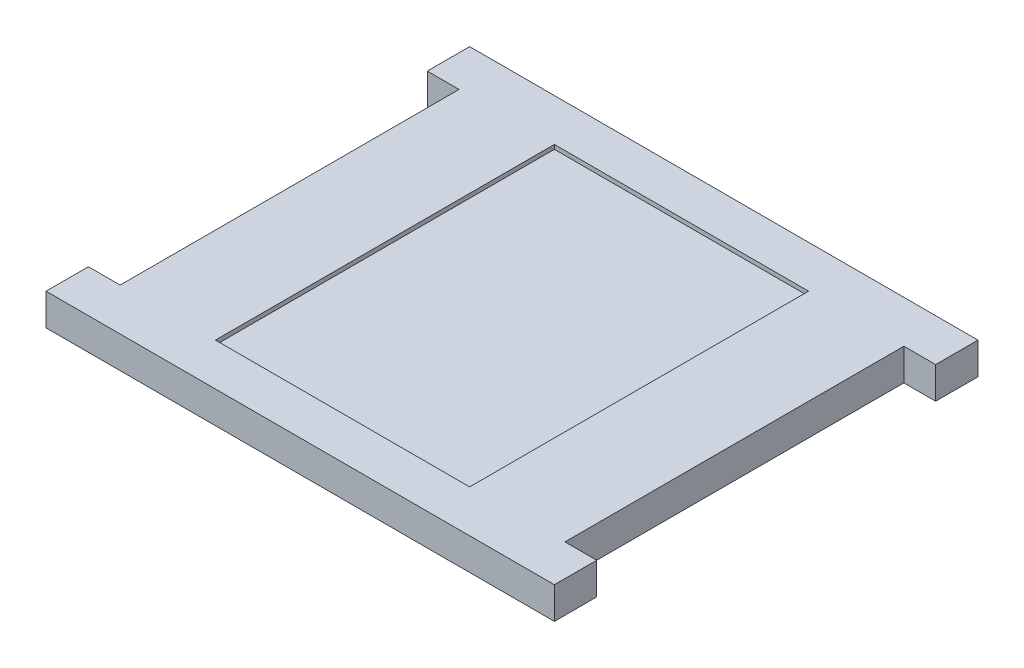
ISO-10303-21;
HEADER;
FILE_DESCRIPTION(('STEP AP214'),'2;1');
FILE_NAME('part.step','',(''),(''),'','','');
FILE_SCHEMA(('AUTOMOTIVE_DESIGN { 1 0 10303 214 1 1 1 1 }'));
ENDSEC;
DATA;
#1=APPLICATION_CONTEXT('core data for automotive mechanical design processes');
#2=APPLICATION_PROTOCOL_DEFINITION('international standard','automotive_design',2000,#1);
#3=PRODUCT_CONTEXT('',#1,'mechanical');
#4=PRODUCT('Part','Part','',(#3));
#5=PRODUCT_RELATED_PRODUCT_CATEGORY('part','',(#4));
#6=PRODUCT_DEFINITION_FORMATION('','',#4);
#7=PRODUCT_DEFINITION_CONTEXT('part definition',#1,'design');
#8=PRODUCT_DEFINITION('design','',#6,#7);
#9=PRODUCT_DEFINITION_SHAPE('','',#8);
#10=(LENGTH_UNIT() NAMED_UNIT(*) SI_UNIT(.MILLI.,.METRE.));
#11=(NAMED_UNIT(*) PLANE_ANGLE_UNIT() SI_UNIT($,.RADIAN.));
#12=(NAMED_UNIT(*) SI_UNIT($,.STERADIAN.) SOLID_ANGLE_UNIT());
#13=UNCERTAINTY_MEASURE_WITH_UNIT(LENGTH_MEASURE(1.E-05),#10,'distance_accuracy_value','');
#14=(GEOMETRIC_REPRESENTATION_CONTEXT(3) GLOBAL_UNCERTAINTY_ASSIGNED_CONTEXT((#13)) GLOBAL_UNIT_ASSIGNED_CONTEXT((#10,
#11,#12)) REPRESENTATION_CONTEXT('',''));
#15=CARTESIAN_POINT('',(0.,0.,0.));
#16=DIRECTION('',(0.,0.,1.));
#17=DIRECTION('',(1.,0.,0.));
#18=AXIS2_PLACEMENT_3D('',#15,#16,#17);
#19=CARTESIAN_POINT('',(49.9180555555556,19.05,-89.9583333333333));
#20=DIRECTION('',(-1.,0.,0.));
#21=DIRECTION('',(0.,0.,1.));
#22=AXIS2_PLACEMENT_3D('',#19,#20,#21);
#23=PLANE('',#22);
#24=DIRECTION('',(0.,1.,0.));
#25=VECTOR('',#24,1.);
#26=CARTESIAN_POINT('',(49.9180555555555,0.,-64.5583333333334));
#27=LINE('',#26,#25);
#28=CARTESIAN_POINT('',(49.9180555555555,0.,-64.5583333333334));
#29=VERTEX_POINT('',#28);
#30=CARTESIAN_POINT('',(49.9180555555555,19.05,-64.5583333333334));
#31=VERTEX_POINT('',#30);
#32=EDGE_CURVE('E199',#29,#31,#27,.T.);
#33=ORIENTED_EDGE('',*,*,#32,.F.);
#34=DIRECTION('',(0.,0.,-1.));
#35=VECTOR('',#34,1.);
#36=CARTESIAN_POINT('',(49.9180555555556,0.,-89.9583333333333));
#37=LINE('',#36,#35);
#38=CARTESIAN_POINT('',(49.9180555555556,0.,-89.9583333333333));
#39=VERTEX_POINT('',#38);
#40=EDGE_CURVE('E251',#29,#39,#37,.T.);
#41=ORIENTED_EDGE('',*,*,#40,.T.);
#42=DIRECTION('',(0.,-1.,0.));
#43=VECTOR('',#42,1.);
#44=CARTESIAN_POINT('',(49.9180555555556,19.05,-89.9583333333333));
#45=LINE('',#44,#43);
#46=CARTESIAN_POINT('',(49.9180555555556,19.05,-89.9583333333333));
#47=VERTEX_POINT('',#46);
#48=EDGE_CURVE('E259',#47,#39,#45,.T.);
#49=ORIENTED_EDGE('',*,*,#48,.F.);
#50=DIRECTION('',(0.,0.,-1.));
#51=VECTOR('',#50,1.);
#52=CARTESIAN_POINT('',(49.9180555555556,19.05,-89.9583333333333));
#53=LINE('',#52,#51);
#54=EDGE_CURVE('E239',#31,#47,#53,.T.);
#55=ORIENTED_EDGE('',*,*,#54,.F.);
#56=EDGE_LOOP('',(#33,#41,#49,#55));
#57=FACE_BOUND('',#56,.T.);
#58=ADVANCED_FACE('F32',(#57),#23,.F.);
#59=DIRECTION('',(0.,1.,0.));
#60=VECTOR('',#59,1.);
#61=CARTESIAN_POINT('',(49.9180555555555,0.,138.641666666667));
#62=LINE('',#61,#60);
#63=CARTESIAN_POINT('',(49.9180555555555,0.,138.641666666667));
#64=VERTEX_POINT('',#63);
#65=CARTESIAN_POINT('',(49.9180555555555,19.05,138.641666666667));
#66=VERTEX_POINT('',#65);
#67=EDGE_CURVE('E202',#64,#66,#62,.T.);
#68=ORIENTED_EDGE('',*,*,#67,.T.);
#69=CARTESIAN_POINT('',(49.9180555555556,19.05,164.041666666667));
#70=VERTEX_POINT('',#69);
#71=EDGE_CURVE('E240',#70,#66,#53,.T.);
#72=ORIENTED_EDGE('',*,*,#71,.F.);
#73=DIRECTION('',(0.,-1.,0.));
#74=VECTOR('',#73,1.);
#75=CARTESIAN_POINT('',(49.9180555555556,19.05,164.041666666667));
#76=LINE('',#75,#74);
#77=CARTESIAN_POINT('',(49.9180555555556,0.,164.041666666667));
#78=VERTEX_POINT('',#77);
#79=EDGE_CURVE('E40',#70,#78,#76,.T.);
#80=ORIENTED_EDGE('',*,*,#79,.T.);
#81=EDGE_CURVE('E252',#78,#64,#37,.T.);
#82=ORIENTED_EDGE('',*,*,#81,.T.);
#83=EDGE_LOOP('',(#68,#72,#80,#82));
#84=FACE_BOUND('',#83,.T.);
#85=ADVANCED_FACE('F266',(#84),#23,.F.);
#86=CARTESIAN_POINT('',(0.,19.05,0.));
#87=DIRECTION('',(0.,1.,0.));
#88=DIRECTION('',(0.,0.,1.));
#89=AXIS2_PLACEMENT_3D('',#86,#87,#88);
#90=PLANE('',#89);
#91=DIRECTION('',(0.,0.,-1.));
#92=VECTOR('',#91,1.);
#93=CARTESIAN_POINT('',(-26.2819444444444,19.05,138.641666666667));
#94=LINE('',#93,#92);
#95=CARTESIAN_POINT('',(-26.2819444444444,19.05,138.641666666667));
#96=VERTEX_POINT('',#95);
#97=CARTESIAN_POINT('',(-26.2819444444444,19.05,-64.5583333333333));
#98=VERTEX_POINT('',#97);
#99=EDGE_CURVE('E47',#96,#98,#94,.T.);
#100=ORIENTED_EDGE('',*,*,#99,.F.);
#101=DIRECTION('',(1.,0.,0.));
#102=VECTOR('',#101,1.);
#103=CARTESIAN_POINT('',(-178.681944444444,19.05,138.641666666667));
#104=LINE('',#103,#102);
#105=CARTESIAN_POINT('',(-178.681944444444,19.05,138.641666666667));
#106=VERTEX_POINT('',#105);
#107=EDGE_CURVE('E165',#106,#96,#104,.T.);
#108=ORIENTED_EDGE('',*,*,#107,.F.);
#109=DIRECTION('',(0.,0.,1.));
#110=VECTOR('',#109,1.);
#111=CARTESIAN_POINT('',(-178.681944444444,19.05,138.641666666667));
#112=LINE('',#111,#110);
#113=CARTESIAN_POINT('',(-178.681944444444,19.05,-64.5583333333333));
#114=VERTEX_POINT('',#113);
#115=EDGE_CURVE('E168',#114,#106,#112,.T.);
#116=ORIENTED_EDGE('',*,*,#115,.F.);
#117=DIRECTION('',(-1.,0.,0.));
#118=VECTOR('',#117,1.);
#119=CARTESIAN_POINT('',(-178.681944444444,19.05,-64.5583333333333));
#120=LINE('',#119,#118);
#121=EDGE_CURVE('E174',#98,#114,#120,.T.);
#122=ORIENTED_EDGE('',*,*,#121,.F.);
#123=EDGE_LOOP('',(#100,#108,#116,#122));
#124=FACE_BOUND('',#123,.T.);
#125=DIRECTION('',(0.,0.,-1.));
#126=VECTOR('',#125,1.);
#127=CARTESIAN_POINT('',(30.8680555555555,19.05,-64.5583333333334));
#128=LINE('',#127,#126);
#129=CARTESIAN_POINT('',(30.8680555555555,19.05,138.641666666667));
#130=VERTEX_POINT('',#129);
#131=CARTESIAN_POINT('',(30.8680555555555,19.05,-64.5583333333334));
#132=VERTEX_POINT('',#131);
#133=EDGE_CURVE('E194',#130,#132,#128,.T.);
#134=ORIENTED_EDGE('',*,*,#133,.T.);
#135=DIRECTION('',(1.,0.,0.));
#136=VECTOR('',#135,1.);
#137=CARTESIAN_POINT('',(49.9180555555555,19.05,-64.5583333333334));
#138=LINE('',#137,#136);
#139=EDGE_CURVE('E180',#132,#31,#138,.T.);
#140=ORIENTED_EDGE('',*,*,#139,.T.);
#141=ORIENTED_EDGE('',*,*,#54,.T.);
#142=DIRECTION('',(-1.,0.,0.));
#143=VECTOR('',#142,1.);
#144=CARTESIAN_POINT('',(-254.881944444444,19.05,-89.9583333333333));
#145=LINE('',#144,#143);
#146=CARTESIAN_POINT('',(-254.881944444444,19.05,-89.9583333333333));
#147=VERTEX_POINT('',#146);
#148=EDGE_CURVE('E243',#47,#147,#145,.T.);
#149=ORIENTED_EDGE('',*,*,#148,.T.);
#150=DIRECTION('',(0.,0.,1.));
#151=VECTOR('',#150,1.);
#152=CARTESIAN_POINT('',(-254.881944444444,19.05,-89.9583333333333));
#153=LINE('',#152,#151);
#154=CARTESIAN_POINT('',(-254.881944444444,19.05,-64.5583333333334));
#155=VERTEX_POINT('',#154);
#156=EDGE_CURVE('E233',#147,#155,#153,.T.);
#157=ORIENTED_EDGE('',*,*,#156,.T.);
#158=DIRECTION('',(-1.,0.,0.));
#159=VECTOR('',#158,1.);
#160=CARTESIAN_POINT('',(-254.881944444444,19.05,-64.5583333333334));
#161=LINE('',#160,#159);
#162=CARTESIAN_POINT('',(-235.831944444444,19.05,-64.5583333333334));
#163=VERTEX_POINT('',#162);
#164=EDGE_CURVE('E201',#163,#155,#161,.T.);
#165=ORIENTED_EDGE('',*,*,#164,.F.);
#166=DIRECTION('',(0.,0.,-1.));
#167=VECTOR('',#166,1.);
#168=CARTESIAN_POINT('',(-235.831944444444,19.05,-64.5583333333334));
#169=LINE('',#168,#167);
#170=CARTESIAN_POINT('',(-235.831944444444,19.05,138.641666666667));
#171=VERTEX_POINT('',#170);
#172=EDGE_CURVE('E211',#171,#163,#169,.T.);
#173=ORIENTED_EDGE('',*,*,#172,.F.);
#174=DIRECTION('',(1.,0.,0.));
#175=VECTOR('',#174,1.);
#176=CARTESIAN_POINT('',(-254.881944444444,19.05,138.641666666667));
#177=LINE('',#176,#175);
#178=CARTESIAN_POINT('',(-254.881944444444,19.05,138.641666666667));
#179=VERTEX_POINT('',#178);
#180=EDGE_CURVE('E219',#179,#171,#177,.T.);
#181=ORIENTED_EDGE('',*,*,#180,.F.);
#182=CARTESIAN_POINT('',(-254.881944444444,19.05,164.041666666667));
#183=VERTEX_POINT('',#182);
#184=EDGE_CURVE('E237',#179,#183,#153,.T.);
#185=ORIENTED_EDGE('',*,*,#184,.T.);
#186=DIRECTION('',(1.,0.,0.));
#187=VECTOR('',#186,1.);
#188=CARTESIAN_POINT('',(-254.881944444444,19.05,164.041666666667));
#189=LINE('',#188,#187);
#190=EDGE_CURVE('E236',#183,#70,#189,.T.);
#191=ORIENTED_EDGE('',*,*,#190,.T.);
#192=ORIENTED_EDGE('',*,*,#71,.T.);
#193=DIRECTION('',(-1.,0.,0.));
#194=VECTOR('',#193,1.);
#195=CARTESIAN_POINT('',(49.9180555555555,19.05,138.641666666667));
#196=LINE('',#195,#194);
#197=EDGE_CURVE('E187',#66,#130,#196,.T.);
#198=ORIENTED_EDGE('',*,*,#197,.T.);
#199=EDGE_LOOP('',(#134,#140,#141,#149,#157,#165,#173,#181,#185,#191,#192,#198));
#200=FACE_BOUND('',#199,.T.);
#201=ADVANCED_FACE('F279',(#124,#200),#90,.T.);
#202=CARTESIAN_POINT('',(0.,0.,0.));
#203=DIRECTION('',(0.,1.,0.));
#204=DIRECTION('',(0.,0.,1.));
#205=AXIS2_PLACEMENT_3D('',#202,#203,#204);
#206=PLANE('',#205);
#207=DIRECTION('',(1.,0.,0.));
#208=VECTOR('',#207,1.);
#209=CARTESIAN_POINT('',(49.9180555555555,0.,-64.5583333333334));
#210=LINE('',#209,#208);
#211=CARTESIAN_POINT('',(30.8680555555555,0.,-64.5583333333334));
#212=VERTEX_POINT('',#211);
#213=EDGE_CURVE('E184',#212,#29,#210,.T.);
#214=ORIENTED_EDGE('',*,*,#213,.F.);
#215=DIRECTION('',(0.,0.,-1.));
#216=VECTOR('',#215,1.);
#217=CARTESIAN_POINT('',(30.8680555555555,0.,-64.5583333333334));
#218=LINE('',#217,#216);
#219=CARTESIAN_POINT('',(30.8680555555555,0.,138.641666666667));
#220=VERTEX_POINT('',#219);
#221=EDGE_CURVE('E186',#220,#212,#218,.T.);
#222=ORIENTED_EDGE('',*,*,#221,.F.);
#223=DIRECTION('',(-1.,0.,0.));
#224=VECTOR('',#223,1.);
#225=CARTESIAN_POINT('',(49.9180555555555,0.,138.641666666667));
#226=LINE('',#225,#224);
#227=EDGE_CURVE('E189',#64,#220,#226,.T.);
#228=ORIENTED_EDGE('',*,*,#227,.F.);
#229=ORIENTED_EDGE('',*,*,#81,.F.);
#230=DIRECTION('',(1.,0.,0.));
#231=VECTOR('',#230,1.);
#232=CARTESIAN_POINT('',(-254.881944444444,0.,164.041666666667));
#233=LINE('',#232,#231);
#234=CARTESIAN_POINT('',(-254.881944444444,0.,164.041666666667));
#235=VERTEX_POINT('',#234);
#236=EDGE_CURVE('E249',#235,#78,#233,.T.);
#237=ORIENTED_EDGE('',*,*,#236,.F.);
#238=DIRECTION('',(0.,0.,1.));
#239=VECTOR('',#238,1.);
#240=CARTESIAN_POINT('',(-254.881944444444,0.,-89.9583333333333));
#241=LINE('',#240,#239);
#242=CARTESIAN_POINT('',(-254.881944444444,0.,138.641666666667));
#243=VERTEX_POINT('',#242);
#244=EDGE_CURVE('E226',#243,#235,#241,.T.);
#245=ORIENTED_EDGE('',*,*,#244,.F.);
#246=DIRECTION('',(1.,0.,0.));
#247=VECTOR('',#246,1.);
#248=CARTESIAN_POINT('',(-254.881944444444,0.,138.641666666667));
#249=LINE('',#248,#247);
#250=CARTESIAN_POINT('',(-235.831944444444,0.,138.641666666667));
#251=VERTEX_POINT('',#250);
#252=EDGE_CURVE('E210',#243,#251,#249,.T.);
#253=ORIENTED_EDGE('',*,*,#252,.T.);
#254=DIRECTION('',(0.,0.,-1.));
#255=VECTOR('',#254,1.);
#256=CARTESIAN_POINT('',(-235.831944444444,0.,-64.5583333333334));
#257=LINE('',#256,#255);
#258=CARTESIAN_POINT('',(-235.831944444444,0.,-64.5583333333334));
#259=VERTEX_POINT('',#258);
#260=EDGE_CURVE('E214',#251,#259,#257,.T.);
#261=ORIENTED_EDGE('',*,*,#260,.T.);
#262=DIRECTION('',(-1.,0.,0.));
#263=VECTOR('',#262,1.);
#264=CARTESIAN_POINT('',(-254.881944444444,0.,-64.5583333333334));
#265=LINE('',#264,#263);
#266=CARTESIAN_POINT('',(-254.881944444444,0.,-64.5583333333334));
#267=VERTEX_POINT('',#266);
#268=EDGE_CURVE('E207',#259,#267,#265,.T.);
#269=ORIENTED_EDGE('',*,*,#268,.T.);
#270=CARTESIAN_POINT('',(-254.881944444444,0.,-89.9583333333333));
#271=VERTEX_POINT('',#270);
#272=EDGE_CURVE('E246',#271,#267,#241,.T.);
#273=ORIENTED_EDGE('',*,*,#272,.F.);
#274=DIRECTION('',(-1.,0.,0.));
#275=VECTOR('',#274,1.);
#276=CARTESIAN_POINT('',(-254.881944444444,0.,-89.9583333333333));
#277=LINE('',#276,#275);
#278=EDGE_CURVE('E255',#39,#271,#277,.T.);
#279=ORIENTED_EDGE('',*,*,#278,.F.);
#280=ORIENTED_EDGE('',*,*,#40,.F.);
#281=EDGE_LOOP('',(#214,#222,#228,#229,#237,#245,#253,#261,#269,#273,#279,#280));
#282=FACE_BOUND('',#281,.T.);
#283=ADVANCED_FACE('F273',(#282),#206,.F.);
#284=CARTESIAN_POINT('',(-254.881944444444,19.05,-89.9583333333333));
#285=DIRECTION('',(1.,0.,0.));
#286=DIRECTION('',(0.,0.,-1.));
#287=AXIS2_PLACEMENT_3D('',#284,#285,#286);
#288=PLANE('',#287);
#289=ORIENTED_EDGE('',*,*,#272,.T.);
#290=DIRECTION('',(0.,1.,0.));
#291=VECTOR('',#290,1.);
#292=CARTESIAN_POINT('',(-254.881944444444,0.,-64.5583333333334));
#293=LINE('',#292,#291);
#294=EDGE_CURVE('E217',#267,#155,#293,.T.);
#295=ORIENTED_EDGE('',*,*,#294,.T.);
#296=ORIENTED_EDGE('',*,*,#156,.F.);
#297=DIRECTION('',(0.,-1.,0.));
#298=VECTOR('',#297,1.);
#299=CARTESIAN_POINT('',(-254.881944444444,19.05,-89.9583333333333));
#300=LINE('',#299,#298);
#301=EDGE_CURVE('E245',#147,#271,#300,.T.);
#302=ORIENTED_EDGE('',*,*,#301,.T.);
#303=EDGE_LOOP('',(#289,#295,#296,#302));
#304=FACE_BOUND('',#303,.T.);
#305=ADVANCED_FACE('F299',(#304),#288,.F.);
#306=ORIENTED_EDGE('',*,*,#184,.F.);
#307=DIRECTION('',(0.,1.,0.));
#308=VECTOR('',#307,1.);
#309=CARTESIAN_POINT('',(-254.881944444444,0.,138.641666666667));
#310=LINE('',#309,#308);
#311=EDGE_CURVE('E229',#243,#179,#310,.T.);
#312=ORIENTED_EDGE('',*,*,#311,.F.);
#313=ORIENTED_EDGE('',*,*,#244,.T.);
#314=DIRECTION('',(0.,-1.,0.));
#315=VECTOR('',#314,1.);
#316=CARTESIAN_POINT('',(-254.881944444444,19.05,164.041666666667));
#317=LINE('',#316,#315);
#318=EDGE_CURVE('E11',#183,#235,#317,.T.);
#319=ORIENTED_EDGE('',*,*,#318,.F.);
#320=EDGE_LOOP('',(#306,#312,#313,#319));
#321=FACE_BOUND('',#320,.T.);
#322=ADVANCED_FACE('F34',(#321),#288,.F.);
#323=CARTESIAN_POINT('',(-254.881944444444,19.05,164.041666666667));
#324=DIRECTION('',(0.,0.,-1.));
#325=DIRECTION('',(-1.,0.,0.));
#326=AXIS2_PLACEMENT_3D('',#323,#324,#325);
#327=PLANE('',#326);
#328=ORIENTED_EDGE('',*,*,#236,.T.);
#329=ORIENTED_EDGE('',*,*,#79,.F.);
#330=ORIENTED_EDGE('',*,*,#190,.F.);
#331=ORIENTED_EDGE('',*,*,#318,.T.);
#332=EDGE_LOOP('',(#328,#329,#330,#331));
#333=FACE_BOUND('',#332,.T.);
#334=ADVANCED_FACE('F283',(#333),#327,.F.);
#335=CARTESIAN_POINT('',(-254.881944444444,19.05,-89.9583333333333));
#336=DIRECTION('',(0.,0.,1.));
#337=DIRECTION('',(1.,0.,0.));
#338=AXIS2_PLACEMENT_3D('',#335,#336,#337);
#339=PLANE('',#338);
#340=ORIENTED_EDGE('',*,*,#278,.T.);
#341=ORIENTED_EDGE('',*,*,#301,.F.);
#342=ORIENTED_EDGE('',*,*,#148,.F.);
#343=ORIENTED_EDGE('',*,*,#48,.T.);
#344=EDGE_LOOP('',(#340,#341,#342,#343));
#345=FACE_BOUND('',#344,.T.);
#346=ADVANCED_FACE('F304',(#345),#339,.F.);
#347=CARTESIAN_POINT('',(-254.881944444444,0.,-64.5583333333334));
#348=DIRECTION('',(0.,0.,-1.));
#349=DIRECTION('',(-1.,0.,0.));
#350=AXIS2_PLACEMENT_3D('',#347,#348,#349);
#351=PLANE('',#350);
#352=ORIENTED_EDGE('',*,*,#164,.T.);
#353=ORIENTED_EDGE('',*,*,#294,.F.);
#354=ORIENTED_EDGE('',*,*,#268,.F.);
#355=DIRECTION('',(0.,1.,0.));
#356=VECTOR('',#355,1.);
#357=CARTESIAN_POINT('',(-235.831944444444,0.,-64.5583333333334));
#358=LINE('',#357,#356);
#359=EDGE_CURVE('E224',#259,#163,#358,.T.);
#360=ORIENTED_EDGE('',*,*,#359,.T.);
#361=EDGE_LOOP('',(#352,#353,#354,#360));
#362=FACE_BOUND('',#361,.T.);
#363=ADVANCED_FACE('F295',(#362),#351,.F.);
#364=CARTESIAN_POINT('',(-235.831944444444,0.,-64.5583333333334));
#365=DIRECTION('',(1.,0.,0.));
#366=DIRECTION('',(0.,0.,-1.));
#367=AXIS2_PLACEMENT_3D('',#364,#365,#366);
#368=PLANE('',#367);
#369=ORIENTED_EDGE('',*,*,#172,.T.);
#370=ORIENTED_EDGE('',*,*,#359,.F.);
#371=ORIENTED_EDGE('',*,*,#260,.F.);
#372=DIRECTION('',(0.,1.,0.));
#373=VECTOR('',#372,1.);
#374=CARTESIAN_POINT('',(-235.831944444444,0.,138.641666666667));
#375=LINE('',#374,#373);
#376=EDGE_CURVE('E227',#251,#171,#375,.T.);
#377=ORIENTED_EDGE('',*,*,#376,.T.);
#378=EDGE_LOOP('',(#369,#370,#371,#377));
#379=FACE_BOUND('',#378,.T.);
#380=ADVANCED_FACE('F291',(#379),#368,.F.);
#381=CARTESIAN_POINT('',(-254.881944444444,0.,138.641666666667));
#382=DIRECTION('',(0.,0.,1.));
#383=DIRECTION('',(1.,0.,0.));
#384=AXIS2_PLACEMENT_3D('',#381,#382,#383);
#385=PLANE('',#384);
#386=ORIENTED_EDGE('',*,*,#180,.T.);
#387=ORIENTED_EDGE('',*,*,#376,.F.);
#388=ORIENTED_EDGE('',*,*,#252,.F.);
#389=ORIENTED_EDGE('',*,*,#311,.T.);
#390=EDGE_LOOP('',(#386,#387,#388,#389));
#391=FACE_BOUND('',#390,.T.);
#392=ADVANCED_FACE('F288',(#391),#385,.F.);
#393=CARTESIAN_POINT('',(49.9180555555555,0.,-64.5583333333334));
#394=DIRECTION('',(0.,0.,1.));
#395=DIRECTION('',(1.,0.,0.));
#396=AXIS2_PLACEMENT_3D('',#393,#394,#395);
#397=PLANE('',#396);
#398=ORIENTED_EDGE('',*,*,#139,.F.);
#399=DIRECTION('',(0.,1.,0.));
#400=VECTOR('',#399,1.);
#401=CARTESIAN_POINT('',(30.8680555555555,0.,-64.5583333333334));
#402=LINE('',#401,#400);
#403=EDGE_CURVE('E191',#212,#132,#402,.T.);
#404=ORIENTED_EDGE('',*,*,#403,.F.);
#405=ORIENTED_EDGE('',*,*,#213,.T.);
#406=ORIENTED_EDGE('',*,*,#32,.T.);
#407=EDGE_LOOP('',(#398,#404,#405,#406));
#408=FACE_BOUND('',#407,.T.);
#409=ADVANCED_FACE('F312',(#408),#397,.T.);
#410=CARTESIAN_POINT('',(49.9180555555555,0.,138.641666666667));
#411=DIRECTION('',(0.,0.,-1.));
#412=DIRECTION('',(-1.,0.,0.));
#413=AXIS2_PLACEMENT_3D('',#410,#411,#412);
#414=PLANE('',#413);
#415=ORIENTED_EDGE('',*,*,#197,.F.);
#416=ORIENTED_EDGE('',*,*,#67,.F.);
#417=ORIENTED_EDGE('',*,*,#227,.T.);
#418=DIRECTION('',(0.,1.,0.));
#419=VECTOR('',#418,1.);
#420=CARTESIAN_POINT('',(30.8680555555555,0.,138.641666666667));
#421=LINE('',#420,#419);
#422=EDGE_CURVE('E55',#220,#130,#421,.T.);
#423=ORIENTED_EDGE('',*,*,#422,.T.);
#424=EDGE_LOOP('',(#415,#416,#417,#423));
#425=FACE_BOUND('',#424,.T.);
#426=ADVANCED_FACE('F277',(#425),#414,.T.);
#427=CARTESIAN_POINT('',(30.8680555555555,0.,-64.5583333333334));
#428=DIRECTION('',(1.,0.,0.));
#429=DIRECTION('',(0.,0.,-1.));
#430=AXIS2_PLACEMENT_3D('',#427,#428,#429);
#431=PLANE('',#430);
#432=ORIENTED_EDGE('',*,*,#133,.F.);
#433=ORIENTED_EDGE('',*,*,#422,.F.);
#434=ORIENTED_EDGE('',*,*,#221,.T.);
#435=ORIENTED_EDGE('',*,*,#403,.T.);
#436=EDGE_LOOP('',(#432,#433,#434,#435));
#437=FACE_BOUND('',#436,.T.);
#438=ADVANCED_FACE('F314',(#437),#431,.T.);
#439=CARTESIAN_POINT('',(-26.2819444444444,16.51,138.641666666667));
#440=DIRECTION('',(1.,0.,0.));
#441=DIRECTION('',(0.,0.,-1.));
#442=AXIS2_PLACEMENT_3D('',#439,#440,#441);
#443=PLANE('',#442);
#444=ORIENTED_EDGE('',*,*,#99,.T.);
#445=DIRECTION('',(0.,1.,0.));
#446=VECTOR('',#445,1.);
#447=CARTESIAN_POINT('',(-26.2819444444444,16.51,-64.5583333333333));
#448=LINE('',#447,#446);
#449=CARTESIAN_POINT('',(-26.2819444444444,16.51,-64.5583333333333));
#450=VERTEX_POINT('',#449);
#451=EDGE_CURVE('E143',#450,#98,#448,.T.);
#452=ORIENTED_EDGE('',*,*,#451,.F.);
#453=DIRECTION('',(0.,0.,-1.));
#454=VECTOR('',#453,1.);
#455=CARTESIAN_POINT('',(-26.2819444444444,16.51,138.641666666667));
#456=LINE('',#455,#454);
#457=CARTESIAN_POINT('',(-26.2819444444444,16.51,138.641666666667));
#458=VERTEX_POINT('',#457);
#459=EDGE_CURVE('E147',#458,#450,#456,.T.);
#460=ORIENTED_EDGE('',*,*,#459,.F.);
#461=DIRECTION('',(0.,1.,0.));
#462=VECTOR('',#461,1.);
#463=CARTESIAN_POINT('',(-26.2819444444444,16.51,138.641666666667));
#464=LINE('',#463,#462);
#465=EDGE_CURVE('E178',#458,#96,#464,.T.);
#466=ORIENTED_EDGE('',*,*,#465,.T.);
#467=EDGE_LOOP('',(#444,#452,#460,#466));
#468=FACE_BOUND('',#467,.T.);
#469=ADVANCED_FACE('F145',(#468),#443,.F.);
#470=CARTESIAN_POINT('',(-178.681944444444,16.51,138.641666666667));
#471=DIRECTION('',(0.,0.,1.));
#472=DIRECTION('',(1.,0.,0.));
#473=AXIS2_PLACEMENT_3D('',#470,#471,#472);
#474=PLANE('',#473);
#475=ORIENTED_EDGE('',*,*,#107,.T.);
#476=ORIENTED_EDGE('',*,*,#465,.F.);
#477=DIRECTION('',(1.,0.,0.));
#478=VECTOR('',#477,1.);
#479=CARTESIAN_POINT('',(-178.681944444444,16.51,138.641666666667));
#480=LINE('',#479,#478);
#481=CARTESIAN_POINT('',(-178.681944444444,16.51,138.641666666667));
#482=VERTEX_POINT('',#481);
#483=EDGE_CURVE('E153',#482,#458,#480,.T.);
#484=ORIENTED_EDGE('',*,*,#483,.F.);
#485=DIRECTION('',(0.,1.,0.));
#486=VECTOR('',#485,1.);
#487=CARTESIAN_POINT('',(-178.681944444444,16.51,138.641666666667));
#488=LINE('',#487,#486);
#489=EDGE_CURVE('E181',#482,#106,#488,.T.);
#490=ORIENTED_EDGE('',*,*,#489,.T.);
#491=EDGE_LOOP('',(#475,#476,#484,#490));
#492=FACE_BOUND('',#491,.T.);
#493=ADVANCED_FACE('F321',(#492),#474,.F.);
#494=CARTESIAN_POINT('',(-178.681944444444,16.51,138.641666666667));
#495=DIRECTION('',(-1.,0.,0.));
#496=DIRECTION('',(0.,0.,1.));
#497=AXIS2_PLACEMENT_3D('',#494,#495,#496);
#498=PLANE('',#497);
#499=ORIENTED_EDGE('',*,*,#115,.T.);
#500=ORIENTED_EDGE('',*,*,#489,.F.);
#501=DIRECTION('',(0.,0.,1.));
#502=VECTOR('',#501,1.);
#503=CARTESIAN_POINT('',(-178.681944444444,16.51,138.641666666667));
#504=LINE('',#503,#502);
#505=CARTESIAN_POINT('',(-178.681944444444,16.51,-64.5583333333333));
#506=VERTEX_POINT('',#505);
#507=EDGE_CURVE('E161',#506,#482,#504,.T.);
#508=ORIENTED_EDGE('',*,*,#507,.F.);
#509=DIRECTION('',(0.,1.,0.));
#510=VECTOR('',#509,1.);
#511=CARTESIAN_POINT('',(-178.681944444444,16.51,-64.5583333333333));
#512=LINE('',#511,#510);
#513=EDGE_CURVE('E152',#506,#114,#512,.T.);
#514=ORIENTED_EDGE('',*,*,#513,.T.);
#515=EDGE_LOOP('',(#499,#500,#508,#514));
#516=FACE_BOUND('',#515,.T.);
#517=ADVANCED_FACE('F390',(#516),#498,.F.);
#518=CARTESIAN_POINT('',(-178.681944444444,16.51,-64.5583333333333));
#519=DIRECTION('',(0.,0.,-1.));
#520=DIRECTION('',(-1.,0.,0.));
#521=AXIS2_PLACEMENT_3D('',#518,#519,#520);
#522=PLANE('',#521);
#523=ORIENTED_EDGE('',*,*,#121,.T.);
#524=ORIENTED_EDGE('',*,*,#513,.F.);
#525=DIRECTION('',(-1.,0.,0.));
#526=VECTOR('',#525,1.);
#527=CARTESIAN_POINT('',(-178.681944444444,16.51,-64.5583333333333));
#528=LINE('',#527,#526);
#529=EDGE_CURVE('E156',#450,#506,#528,.T.);
#530=ORIENTED_EDGE('',*,*,#529,.F.);
#531=ORIENTED_EDGE('',*,*,#451,.T.);
#532=EDGE_LOOP('',(#523,#524,#530,#531));
#533=FACE_BOUND('',#532,.T.);
#534=ADVANCED_FACE('F157',(#533),#522,.F.);
#535=CARTESIAN_POINT('',(0.,16.51,0.));
#536=DIRECTION('',(0.,-1.,0.));
#537=DIRECTION('',(0.,0.,-1.));
#538=AXIS2_PLACEMENT_3D('',#535,#536,#537);
#539=PLANE('',#538);
#540=ORIENTED_EDGE('',*,*,#459,.T.);
#541=ORIENTED_EDGE('',*,*,#529,.T.);
#542=ORIENTED_EDGE('',*,*,#507,.T.);
#543=ORIENTED_EDGE('',*,*,#483,.T.);
#544=EDGE_LOOP('',(#540,#541,#542,#543));
#545=FACE_BOUND('',#544,.T.);
#546=ADVANCED_FACE('F163',(#545),#539,.F.);
#547=CLOSED_SHELL('',(#58,#85,#201,#283,#305,#322,#334,#346,#363,#380,#392,#409,#426,#438,#469,
#493,#517,#534,#546));
#548=MANIFOLD_SOLID_BREP('B2',#547);
#549=ADVANCED_BREP_SHAPE_REPRESENTATION('',(#18,#548),#14);
#550=SHAPE_DEFINITION_REPRESENTATION(#9,#549);
ENDSEC;
END-ISO-10303-21;
